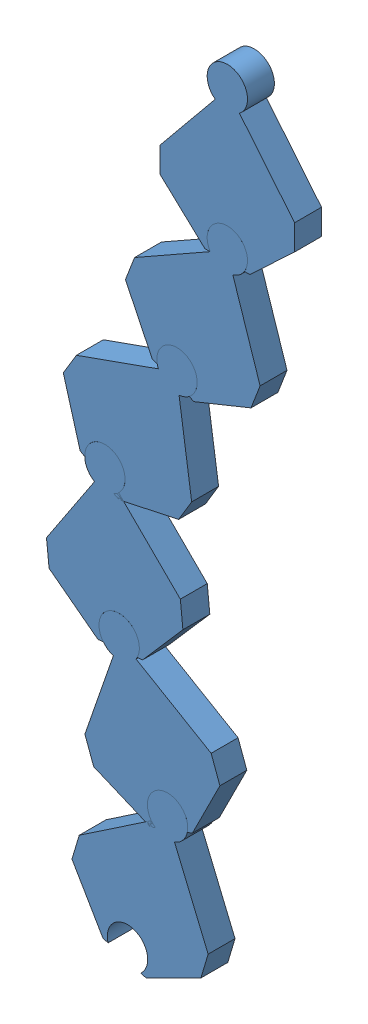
SolidWorks assembly OGRANICZNIK RUCHU.SLDASM, configuration Standard (file format 3400). Lengths in mm.
Overall size (98.37 317.6 10).
6 component instances, 1 part files, 15 mates.
Components (placement in the parent):
- OGNIWO-1: OGNIWO.SLDPRT [Standard] at origin size (50 71.24 10)
- OGNIWO-2: OGNIWO.SLDPRT [Standard] at (-11.1498 -49.9254 0) x (0.933079 -0.359672 0) z (0 0 1) size (50 71.24 10)
- OGNIWO-3: OGNIWO.SLDPRT [Standard] at (-34.6771 -96.0875 0) x (0.857012 -0.515296 0) z (0 0 1) size (50 71.24 10)
- OGNIWO-4: OGNIWO.SLDPRT [Standard] at (-42.3372 -144.9231 0) x (0.994787 0.101971 0) z (0 0 1) size (50 71.24 10)
- OGNIWO-5: OGNIWO.SLDPRT [Standard] at (-29.4745 -194.9007 0) x (0.93829 0.34585 0) z (0 0 1) size (50 71.24 10)
- OGNIWO-6: OGNIWO.SLDPRT [Standard] at (-31.0868 -244.3072 0) x (0.958142 -0.286294 0) z (0 0 1) size (50 71.24 10)
Mates (geometry in assembly coordinates):
- Deckungsgleich1: coincident aligned: plane of OGNIWO-1 through (0 -56.8781 -10) normal (0 0 -1); plane of OGNIWO-2 through (-31.6073 -102.9972 -10) normal (0 0 -1)
- Deckungsgleich2: coincident aligned: plane of OGNIWO-1 through (0 -56.8781 -10) normal (0 0 -1); plane of OGNIWO-3 through (-63.9862 -144.8327 -10) normal (0 0 -1)
- Deckungsgleich3: coincident aligned: plane of OGNIWO-1 through (0 -56.8781 -10) normal (0 0 -1); plane of OGNIWO-4 through (-36.5373 -201.5048 -10) normal (0 0 -1)
- Deckungsgleich4: coincident aligned: plane of OGNIWO-1 through (0 -56.8781 -10) normal (0 0 -1); plane of OGNIWO-5 through (-9.8032 -248.2688 -10) normal (0 0 -1)
- Deckungsgleich5: coincident aligned: plane of OGNIWO-1 through (0 -56.8781 -10) normal (0 0 -1); plane of OGNIWO-6 through (-47.3706 -298.8045 -10) normal (0 0 -1)
- Konzentrisch1: concentric aligned: cylinder of OGNIWO-1; cylinder of OGNIWO-2
- Konzentrisch2: concentric aligned: cylinder of OGNIWO-2; cylinder of OGNIWO-3
- Konzentrisch3: concentric aligned: cylinder of OGNIWO-3; cylinder of OGNIWO-4
- Konzentrisch4: concentric aligned: cylinder of OGNIWO-4; cylinder of OGNIWO-5
- Konzentrisch5: concentric aligned: cylinder of OGNIWO-5; cylinder of OGNIWO-6
- Deckungsgleich8: coincident: curve of OGNIWO-2
- Deckungsgleich9: coincident: unknown of OGNIWO-3
- Deckungsgleich10: coincident: unknown of OGNIWO-4
- Deckungsgleich12: coincident: unknown of OGNIWO-5
- Deckungsgleich13: coincident: unknown of OGNIWO-6
